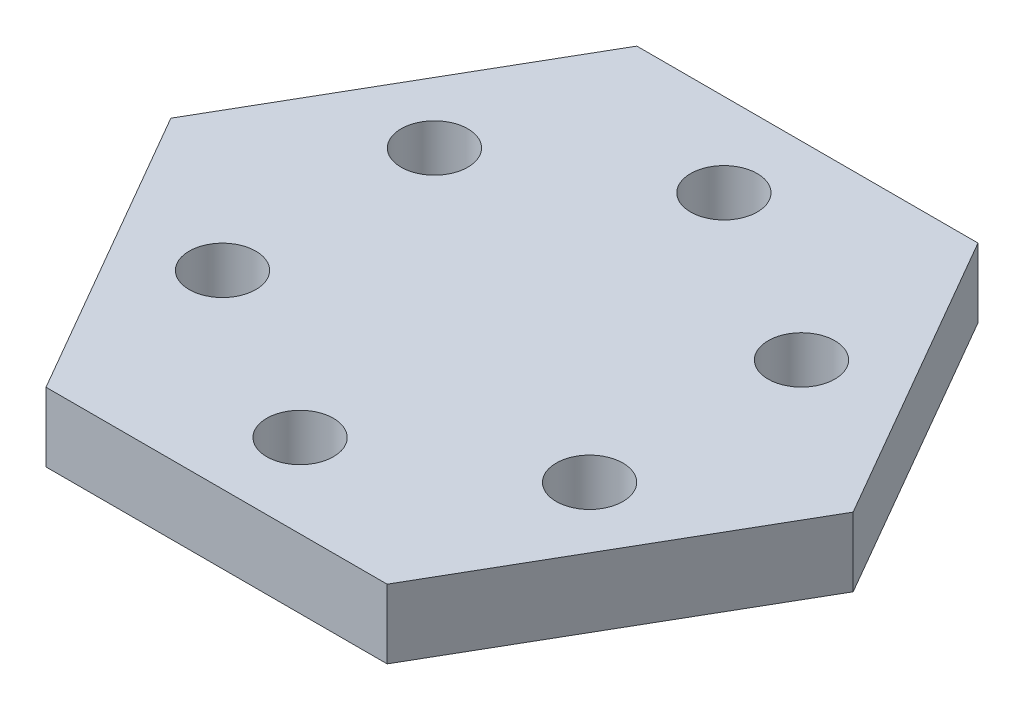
ISO-10303-21;
HEADER;
FILE_DESCRIPTION(('STEP AP214'),'2;1');
FILE_NAME('part.step','',(''),(''),'','','');
FILE_SCHEMA(('AUTOMOTIVE_DESIGN { 1 0 10303 214 1 1 1 1 }'));
ENDSEC;
DATA;
#1=APPLICATION_CONTEXT('core data for automotive mechanical design processes');
#2=APPLICATION_PROTOCOL_DEFINITION('international standard','automotive_design',2000,#1);
#3=PRODUCT_CONTEXT('',#1,'mechanical');
#4=PRODUCT('Part','Part','',(#3));
#5=PRODUCT_RELATED_PRODUCT_CATEGORY('part','',(#4));
#6=PRODUCT_DEFINITION_FORMATION('','',#4);
#7=PRODUCT_DEFINITION_CONTEXT('part definition',#1,'design');
#8=PRODUCT_DEFINITION('design','',#6,#7);
#9=PRODUCT_DEFINITION_SHAPE('','',#8);
#10=(LENGTH_UNIT() NAMED_UNIT(*) SI_UNIT(.MILLI.,.METRE.));
#11=(NAMED_UNIT(*) PLANE_ANGLE_UNIT() SI_UNIT($,.RADIAN.));
#12=(NAMED_UNIT(*) SI_UNIT($,.STERADIAN.) SOLID_ANGLE_UNIT());
#13=UNCERTAINTY_MEASURE_WITH_UNIT(LENGTH_MEASURE(1.E-05),#10,'distance_accuracy_value','');
#14=(GEOMETRIC_REPRESENTATION_CONTEXT(3) GLOBAL_UNCERTAINTY_ASSIGNED_CONTEXT((#13)) GLOBAL_UNIT_ASSIGNED_CONTEXT((#10,
#11,#12)) REPRESENTATION_CONTEXT('',''));
#15=CARTESIAN_POINT('',(0.,0.,0.));
#16=DIRECTION('',(0.,0.,1.));
#17=DIRECTION('',(1.,0.,0.));
#18=AXIS2_PLACEMENT_3D('',#15,#16,#17);
#19=CARTESIAN_POINT('',(-38.8991070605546,15.748,67.3752297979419));
#20=DIRECTION('',(0.,0.,-1.));
#21=DIRECTION('',(-1.,0.,0.));
#22=AXIS2_PLACEMENT_3D('',#19,#20,#21);
#23=PLANE('',#22);
#24=DIRECTION('',(1.,0.,0.));
#25=VECTOR('',#24,1.);
#26=CARTESIAN_POINT('',(-38.8991070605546,0.,67.3752297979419));
#27=LINE('',#26,#25);
#28=CARTESIAN_POINT('',(-38.8991070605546,0.,67.3752297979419));
#29=VERTEX_POINT('',#28);
#30=CARTESIAN_POINT('',(38.8991070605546,0.,67.3752297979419));
#31=VERTEX_POINT('',#30);
#32=EDGE_CURVE('E115',#29,#31,#27,.T.);
#33=ORIENTED_EDGE('',*,*,#32,.T.);
#34=DIRECTION('',(0.,-1.,0.));
#35=VECTOR('',#34,1.);
#36=CARTESIAN_POINT('',(38.8991070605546,15.748,67.3752297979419));
#37=LINE('',#36,#35);
#38=CARTESIAN_POINT('',(38.8991070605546,15.748,67.3752297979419));
#39=VERTEX_POINT('',#38);
#40=EDGE_CURVE('E11',#39,#31,#37,.T.);
#41=ORIENTED_EDGE('',*,*,#40,.F.);
#42=DIRECTION('',(1.,0.,0.));
#43=VECTOR('',#42,1.);
#44=CARTESIAN_POINT('',(-38.8991070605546,15.748,67.3752297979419));
#45=LINE('',#44,#43);
#46=CARTESIAN_POINT('',(-38.8991070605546,15.748,67.3752297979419));
#47=VERTEX_POINT('',#46);
#48=EDGE_CURVE('E126',#47,#39,#45,.T.);
#49=ORIENTED_EDGE('',*,*,#48,.F.);
#50=DIRECTION('',(0.,-1.,0.));
#51=VECTOR('',#50,1.);
#52=CARTESIAN_POINT('',(-38.8991070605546,15.748,67.3752297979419));
#53=LINE('',#52,#51);
#54=EDGE_CURVE('E111',#47,#29,#53,.T.);
#55=ORIENTED_EDGE('',*,*,#54,.T.);
#56=EDGE_LOOP('',(#33,#41,#49,#55));
#57=FACE_BOUND('',#56,.T.);
#58=ADVANCED_FACE('F31',(#57),#23,.F.);
#59=CARTESIAN_POINT('',(38.8991070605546,15.748,67.3752297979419));
#60=DIRECTION('',(-0.866025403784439,0.,-0.5));
#61=DIRECTION('',(-0.5,0.,0.866025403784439));
#62=AXIS2_PLACEMENT_3D('',#59,#60,#61);
#63=PLANE('',#62);
#64=DIRECTION('',(0.5,0.,-0.866025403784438));
#65=VECTOR('',#64,1.);
#66=CARTESIAN_POINT('',(38.8991070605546,0.,67.3752297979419));
#67=LINE('',#66,#65);
#68=CARTESIAN_POINT('',(77.7982141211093,0.,0.));
#69=VERTEX_POINT('',#68);
#70=EDGE_CURVE('E118',#31,#69,#67,.T.);
#71=ORIENTED_EDGE('',*,*,#70,.T.);
#72=DIRECTION('',(0.,-1.,0.));
#73=VECTOR('',#72,1.);
#74=CARTESIAN_POINT('',(77.7982141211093,15.748,0.));
#75=LINE('',#74,#73);
#76=CARTESIAN_POINT('',(77.7982141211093,15.748,0.));
#77=VERTEX_POINT('',#76);
#78=EDGE_CURVE('E39',#77,#69,#75,.T.);
#79=ORIENTED_EDGE('',*,*,#78,.F.);
#80=DIRECTION('',(0.5,0.,-0.866025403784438));
#81=VECTOR('',#80,1.);
#82=CARTESIAN_POINT('',(38.8991070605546,15.748,67.3752297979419));
#83=LINE('',#82,#81);
#84=EDGE_CURVE('E84',#39,#77,#83,.T.);
#85=ORIENTED_EDGE('',*,*,#84,.F.);
#86=ORIENTED_EDGE('',*,*,#40,.T.);
#87=EDGE_LOOP('',(#71,#79,#85,#86));
#88=FACE_BOUND('',#87,.T.);
#89=ADVANCED_FACE('F151',(#88),#63,.F.);
#90=CARTESIAN_POINT('',(77.7982141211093,15.748,0.));
#91=DIRECTION('',(-0.866025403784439,0.,0.5));
#92=DIRECTION('',(0.5,0.,0.866025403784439));
#93=AXIS2_PLACEMENT_3D('',#90,#91,#92);
#94=PLANE('',#93);
#95=DIRECTION('',(-0.5,0.,-0.866025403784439));
#96=VECTOR('',#95,1.);
#97=CARTESIAN_POINT('',(77.7982141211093,0.,0.));
#98=LINE('',#97,#96);
#99=CARTESIAN_POINT('',(38.8991070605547,0.,-67.3752297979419));
#100=VERTEX_POINT('',#99);
#101=EDGE_CURVE('E121',#69,#100,#98,.T.);
#102=ORIENTED_EDGE('',*,*,#101,.T.);
#103=DIRECTION('',(0.,-1.,0.));
#104=VECTOR('',#103,1.);
#105=CARTESIAN_POINT('',(38.8991070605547,15.748,-67.3752297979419));
#106=LINE('',#105,#104);
#107=CARTESIAN_POINT('',(38.8991070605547,15.748,-67.3752297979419));
#108=VERTEX_POINT('',#107);
#109=EDGE_CURVE('E106',#108,#100,#106,.T.);
#110=ORIENTED_EDGE('',*,*,#109,.F.);
#111=DIRECTION('',(-0.5,0.,-0.866025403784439));
#112=VECTOR('',#111,1.);
#113=CARTESIAN_POINT('',(77.7982141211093,15.748,0.));
#114=LINE('',#113,#112);
#115=EDGE_CURVE('E97',#77,#108,#114,.T.);
#116=ORIENTED_EDGE('',*,*,#115,.F.);
#117=ORIENTED_EDGE('',*,*,#78,.T.);
#118=EDGE_LOOP('',(#102,#110,#116,#117));
#119=FACE_BOUND('',#118,.T.);
#120=ADVANCED_FACE('F132',(#119),#94,.F.);
#121=CARTESIAN_POINT('',(38.8991070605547,15.748,-67.3752297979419));
#122=DIRECTION('',(0.,0.,1.));
#123=DIRECTION('',(1.,0.,0.));
#124=AXIS2_PLACEMENT_3D('',#121,#122,#123);
#125=PLANE('',#124);
#126=DIRECTION('',(-1.,0.,0.));
#127=VECTOR('',#126,1.);
#128=CARTESIAN_POINT('',(38.8991070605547,0.,-67.3752297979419));
#129=LINE('',#128,#127);
#130=CARTESIAN_POINT('',(-38.8991070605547,0.,-67.3752297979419));
#131=VERTEX_POINT('',#130);
#132=EDGE_CURVE('E105',#100,#131,#129,.T.);
#133=ORIENTED_EDGE('',*,*,#132,.T.);
#134=DIRECTION('',(0.,-1.,0.));
#135=VECTOR('',#134,1.);
#136=CARTESIAN_POINT('',(-38.8991070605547,15.748,-67.3752297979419));
#137=LINE('',#136,#135);
#138=CARTESIAN_POINT('',(-38.8991070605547,15.748,-67.3752297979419));
#139=VERTEX_POINT('',#138);
#140=EDGE_CURVE('E102',#139,#131,#137,.T.);
#141=ORIENTED_EDGE('',*,*,#140,.F.);
#142=DIRECTION('',(-1.,0.,0.));
#143=VECTOR('',#142,1.);
#144=CARTESIAN_POINT('',(38.8991070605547,15.748,-67.3752297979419));
#145=LINE('',#144,#143);
#146=EDGE_CURVE('E91',#108,#139,#145,.T.);
#147=ORIENTED_EDGE('',*,*,#146,.F.);
#148=ORIENTED_EDGE('',*,*,#109,.T.);
#149=EDGE_LOOP('',(#133,#141,#147,#148));
#150=FACE_BOUND('',#149,.T.);
#151=ADVANCED_FACE('F103',(#150),#125,.F.);
#152=CARTESIAN_POINT('',(-38.8991070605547,15.748,-67.3752297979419));
#153=DIRECTION('',(0.866025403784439,0.,0.5));
#154=DIRECTION('',(0.5,0.,-0.866025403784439));
#155=AXIS2_PLACEMENT_3D('',#152,#153,#154);
#156=PLANE('',#155);
#157=DIRECTION('',(-0.5,0.,0.866025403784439));
#158=VECTOR('',#157,1.);
#159=CARTESIAN_POINT('',(-38.8991070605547,0.,-67.3752297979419));
#160=LINE('',#159,#158);
#161=CARTESIAN_POINT('',(-77.7982141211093,0.,0.));
#162=VERTEX_POINT('',#161);
#163=EDGE_CURVE('E70',#131,#162,#160,.T.);
#164=ORIENTED_EDGE('',*,*,#163,.T.);
#165=DIRECTION('',(0.,-1.,0.));
#166=VECTOR('',#165,1.);
#167=CARTESIAN_POINT('',(-77.7982141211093,15.748,0.));
#168=LINE('',#167,#166);
#169=CARTESIAN_POINT('',(-77.7982141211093,15.748,0.));
#170=VERTEX_POINT('',#169);
#171=EDGE_CURVE('E107',#170,#162,#168,.T.);
#172=ORIENTED_EDGE('',*,*,#171,.F.);
#173=DIRECTION('',(-0.5,0.,0.866025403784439));
#174=VECTOR('',#173,1.);
#175=CARTESIAN_POINT('',(-38.8991070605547,15.748,-67.3752297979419));
#176=LINE('',#175,#174);
#177=EDGE_CURVE('E95',#139,#170,#176,.T.);
#178=ORIENTED_EDGE('',*,*,#177,.F.);
#179=ORIENTED_EDGE('',*,*,#140,.T.);
#180=EDGE_LOOP('',(#164,#172,#178,#179));
#181=FACE_BOUND('',#180,.T.);
#182=ADVANCED_FACE('F109',(#181),#156,.F.);
#183=CARTESIAN_POINT('',(-77.7982141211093,15.748,0.));
#184=DIRECTION('',(0.866025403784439,0.,-0.5));
#185=DIRECTION('',(-0.5,0.,-0.866025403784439));
#186=AXIS2_PLACEMENT_3D('',#183,#184,#185);
#187=PLANE('',#186);
#188=DIRECTION('',(0.5,0.,0.866025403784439));
#189=VECTOR('',#188,1.);
#190=CARTESIAN_POINT('',(-77.7982141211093,0.,0.));
#191=LINE('',#190,#189);
#192=EDGE_CURVE('E76',#162,#29,#191,.T.);
#193=ORIENTED_EDGE('',*,*,#192,.T.);
#194=ORIENTED_EDGE('',*,*,#54,.F.);
#195=DIRECTION('',(0.5,0.,0.866025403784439));
#196=VECTOR('',#195,1.);
#197=CARTESIAN_POINT('',(-77.7982141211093,15.748,0.));
#198=LINE('',#197,#196);
#199=EDGE_CURVE('E47',#170,#47,#198,.T.);
#200=ORIENTED_EDGE('',*,*,#199,.F.);
#201=ORIENTED_EDGE('',*,*,#171,.T.);
#202=EDGE_LOOP('',(#193,#194,#200,#201));
#203=FACE_BOUND('',#202,.T.);
#204=ADVANCED_FACE('F139',(#203),#187,.F.);
#205=CARTESIAN_POINT('',(38.8991070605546,15.748,67.3752297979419));
#206=DIRECTION('',(0.,1.,0.));
#207=DIRECTION('',(0.,0.,1.));
#208=AXIS2_PLACEMENT_3D('',#205,#206,#207);
#209=PLANE('',#208);
#210=CARTESIAN_POINT('',(41.8552111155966,15.748,24.165117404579));
#211=DIRECTION('',(0.,1.,0.));
#212=DIRECTION('',(0.866025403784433,0.,0.50000000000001));
#213=AXIS2_PLACEMENT_3D('',#210,#211,#212);
#214=CIRCLE('',#213,7.60476981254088);
#215=CARTESIAN_POINT('',(48.44113496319,15.748,27.9675023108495));
#216=VERTEX_POINT('',#215);
#217=EDGE_CURVE('E257',#216,#216,#214,.T.);
#218=ORIENTED_EDGE('',*,*,#217,.F.);
#219=EDGE_LOOP('',(#218));
#220=FACE_BOUND('',#219,.T.);
#221=CARTESIAN_POINT('',(41.8552111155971,15.748,-24.1651174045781));
#222=DIRECTION('',(0.,1.,0.));
#223=DIRECTION('',(0.866025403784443,0.,-0.499999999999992));
#224=AXIS2_PLACEMENT_3D('',#221,#222,#223);
#225=CIRCLE('',#224,7.60476981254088);
#226=CARTESIAN_POINT('',(48.4411349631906,15.748,-27.9675023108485));
#227=VERTEX_POINT('',#226);
#228=EDGE_CURVE('E259',#227,#227,#225,.T.);
#229=ORIENTED_EDGE('',*,*,#228,.F.);
#230=EDGE_LOOP('',(#229));
#231=FACE_BOUND('',#230,.T.);
#232=CARTESIAN_POINT('',(3.37488421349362E-13,15.748,-48.330234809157));
#233=DIRECTION('',(0.,1.,0.));
#234=DIRECTION('',(0.,0.,-1.));
#235=AXIS2_PLACEMENT_3D('',#232,#233,#234);
#236=CIRCLE('',#235,7.60476981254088);
#237=CARTESIAN_POINT('',(3.90592275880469E-13,15.748,-55.9350046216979));
#238=VERTEX_POINT('',#237);
#239=EDGE_CURVE('E265',#238,#238,#236,.T.);
#240=ORIENTED_EDGE('',*,*,#239,.F.);
#241=EDGE_LOOP('',(#240));
#242=FACE_BOUND('',#241,.T.);
#243=CARTESIAN_POINT('',(-41.8552111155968,15.748,-24.1651174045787));
#244=DIRECTION('',(0.,1.,0.));
#245=DIRECTION('',(-0.866025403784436,0.,-0.500000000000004));
#246=AXIS2_PLACEMENT_3D('',#243,#244,#245);
#247=CIRCLE('',#246,7.60476981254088);
#248=CARTESIAN_POINT('',(-48.4411349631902,15.748,-27.9675023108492));
#249=VERTEX_POINT('',#248);
#250=EDGE_CURVE('E271',#249,#249,#247,.T.);
#251=ORIENTED_EDGE('',*,*,#250,.F.);
#252=EDGE_LOOP('',(#251));
#253=FACE_BOUND('',#252,.T.);
#254=CARTESIAN_POINT('',(-41.855211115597,15.748,24.1651174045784));
#255=DIRECTION('',(0.,1.,0.));
#256=DIRECTION('',(-0.86602540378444,0.,0.499999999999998));
#257=AXIS2_PLACEMENT_3D('',#254,#255,#256);
#258=CIRCLE('',#257,7.60476981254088);
#259=CARTESIAN_POINT('',(-48.4411349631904,15.748,27.9675023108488));
#260=VERTEX_POINT('',#259);
#261=EDGE_CURVE('E277',#260,#260,#258,.T.);
#262=ORIENTED_EDGE('',*,*,#261,.F.);
#263=EDGE_LOOP('',(#262));
#264=FACE_BOUND('',#263,.T.);
#265=CARTESIAN_POINT('',(0.,15.748,48.330234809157));
#266=DIRECTION('',(0.,1.,0.));
#267=DIRECTION('',(0.,0.,1.));
#268=AXIS2_PLACEMENT_3D('',#265,#266,#267);
#269=CIRCLE('',#268,7.60476981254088);
#270=CARTESIAN_POINT('',(0.,15.748,55.9350046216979));
#271=VERTEX_POINT('',#270);
#272=EDGE_CURVE('E283',#271,#271,#269,.T.);
#273=ORIENTED_EDGE('',*,*,#272,.F.);
#274=EDGE_LOOP('',(#273));
#275=FACE_BOUND('',#274,.T.);
#276=ORIENTED_EDGE('',*,*,#48,.T.);
#277=ORIENTED_EDGE('',*,*,#84,.T.);
#278=ORIENTED_EDGE('',*,*,#115,.T.);
#279=ORIENTED_EDGE('',*,*,#146,.T.);
#280=ORIENTED_EDGE('',*,*,#177,.T.);
#281=ORIENTED_EDGE('',*,*,#199,.T.);
#282=EDGE_LOOP('',(#276,#277,#278,#279,#280,#281));
#283=FACE_BOUND('',#282,.T.);
#284=ADVANCED_FACE('F93',(#220,#231,#242,#253,#264,#275,#283),#209,.T.);
#285=CARTESIAN_POINT('',(38.8991070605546,0.,67.3752297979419));
#286=DIRECTION('',(0.,1.,0.));
#287=DIRECTION('',(0.,0.,1.));
#288=AXIS2_PLACEMENT_3D('',#285,#286,#287);
#289=PLANE('',#288);
#290=CARTESIAN_POINT('',(41.8552111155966,0.,24.165117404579));
#291=DIRECTION('',(0.,1.,0.));
#292=DIRECTION('',(0.866025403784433,0.,0.50000000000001));
#293=AXIS2_PLACEMENT_3D('',#290,#291,#292);
#294=CIRCLE('',#293,7.60476981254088);
#295=CARTESIAN_POINT('',(48.44113496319,0.,27.9675023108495));
#296=VERTEX_POINT('',#295);
#297=EDGE_CURVE('E254',#296,#296,#294,.T.);
#298=ORIENTED_EDGE('',*,*,#297,.T.);
#299=EDGE_LOOP('',(#298));
#300=FACE_BOUND('',#299,.T.);
#301=CARTESIAN_POINT('',(41.8552111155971,0.,-24.1651174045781));
#302=DIRECTION('',(0.,1.,0.));
#303=DIRECTION('',(0.866025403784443,0.,-0.499999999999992));
#304=AXIS2_PLACEMENT_3D('',#301,#302,#303);
#305=CIRCLE('',#304,7.60476981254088);
#306=CARTESIAN_POINT('',(48.4411349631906,0.,-27.9675023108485));
#307=VERTEX_POINT('',#306);
#308=EDGE_CURVE('E262',#307,#307,#305,.T.);
#309=ORIENTED_EDGE('',*,*,#308,.T.);
#310=EDGE_LOOP('',(#309));
#311=FACE_BOUND('',#310,.T.);
#312=CARTESIAN_POINT('',(3.37488421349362E-13,0.,-48.330234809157));
#313=DIRECTION('',(0.,1.,0.));
#314=DIRECTION('',(0.,0.,-1.));
#315=AXIS2_PLACEMENT_3D('',#312,#313,#314);
#316=CIRCLE('',#315,7.60476981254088);
#317=CARTESIAN_POINT('',(3.90592275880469E-13,0.,-55.9350046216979));
#318=VERTEX_POINT('',#317);
#319=EDGE_CURVE('E268',#318,#318,#316,.T.);
#320=ORIENTED_EDGE('',*,*,#319,.T.);
#321=EDGE_LOOP('',(#320));
#322=FACE_BOUND('',#321,.T.);
#323=CARTESIAN_POINT('',(-41.8552111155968,0.,-24.1651174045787));
#324=DIRECTION('',(0.,1.,0.));
#325=DIRECTION('',(-0.866025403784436,0.,-0.500000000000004));
#326=AXIS2_PLACEMENT_3D('',#323,#324,#325);
#327=CIRCLE('',#326,7.60476981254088);
#328=CARTESIAN_POINT('',(-48.4411349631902,0.,-27.9675023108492));
#329=VERTEX_POINT('',#328);
#330=EDGE_CURVE('E274',#329,#329,#327,.T.);
#331=ORIENTED_EDGE('',*,*,#330,.T.);
#332=EDGE_LOOP('',(#331));
#333=FACE_BOUND('',#332,.T.);
#334=CARTESIAN_POINT('',(-41.855211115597,0.,24.1651174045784));
#335=DIRECTION('',(0.,1.,0.));
#336=DIRECTION('',(-0.86602540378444,0.,0.499999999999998));
#337=AXIS2_PLACEMENT_3D('',#334,#335,#336);
#338=CIRCLE('',#337,7.60476981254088);
#339=CARTESIAN_POINT('',(-48.4411349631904,0.,27.9675023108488));
#340=VERTEX_POINT('',#339);
#341=EDGE_CURVE('E280',#340,#340,#338,.T.);
#342=ORIENTED_EDGE('',*,*,#341,.T.);
#343=EDGE_LOOP('',(#342));
#344=FACE_BOUND('',#343,.T.);
#345=CARTESIAN_POINT('',(0.,0.,48.330234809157));
#346=DIRECTION('',(0.,1.,0.));
#347=DIRECTION('',(0.,0.,1.));
#348=AXIS2_PLACEMENT_3D('',#345,#346,#347);
#349=CIRCLE('',#348,7.60476981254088);
#350=CARTESIAN_POINT('',(0.,0.,55.9350046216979));
#351=VERTEX_POINT('',#350);
#352=EDGE_CURVE('E119',#351,#351,#349,.T.);
#353=ORIENTED_EDGE('',*,*,#352,.T.);
#354=EDGE_LOOP('',(#353));
#355=FACE_BOUND('',#354,.T.);
#356=ORIENTED_EDGE('',*,*,#32,.F.);
#357=ORIENTED_EDGE('',*,*,#192,.F.);
#358=ORIENTED_EDGE('',*,*,#163,.F.);
#359=ORIENTED_EDGE('',*,*,#132,.F.);
#360=ORIENTED_EDGE('',*,*,#101,.F.);
#361=ORIENTED_EDGE('',*,*,#70,.F.);
#362=EDGE_LOOP('',(#356,#357,#358,#359,#360,#361));
#363=FACE_BOUND('',#362,.T.);
#364=ADVANCED_FACE('F135',(#300,#311,#322,#333,#344,#355,#363),#289,.F.);
#365=CARTESIAN_POINT('',(0.,0.,48.330234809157));
#366=DIRECTION('',(0.,1.,0.));
#367=DIRECTION('',(0.,0.,1.));
#368=AXIS2_PLACEMENT_3D('',#365,#366,#367);
#369=CYLINDRICAL_SURFACE('',#368,7.60476981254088);
#370=ORIENTED_EDGE('',*,*,#352,.F.);
#371=EDGE_LOOP('',(#370));
#372=FACE_BOUND('',#371,.T.);
#373=ORIENTED_EDGE('',*,*,#272,.T.);
#374=EDGE_LOOP('',(#373));
#375=FACE_BOUND('',#374,.T.);
#376=ADVANCED_FACE('F179',(#372,#375),#369,.F.);
#377=CARTESIAN_POINT('',(-41.855211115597,0.,24.1651174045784));
#378=DIRECTION('',(0.,1.,0.));
#379=DIRECTION('',(0.,0.,1.));
#380=AXIS2_PLACEMENT_3D('',#377,#378,#379);
#381=CYLINDRICAL_SURFACE('',#380,7.60476981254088);
#382=ORIENTED_EDGE('',*,*,#341,.F.);
#383=EDGE_LOOP('',(#382));
#384=FACE_BOUND('',#383,.T.);
#385=ORIENTED_EDGE('',*,*,#261,.T.);
#386=EDGE_LOOP('',(#385));
#387=FACE_BOUND('',#386,.T.);
#388=ADVANCED_FACE('F184',(#384,#387),#381,.F.);
#389=CARTESIAN_POINT('',(-41.8552111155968,0.,-24.1651174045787));
#390=DIRECTION('',(0.,1.,0.));
#391=DIRECTION('',(0.,0.,1.));
#392=AXIS2_PLACEMENT_3D('',#389,#390,#391);
#393=CYLINDRICAL_SURFACE('',#392,7.60476981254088);
#394=ORIENTED_EDGE('',*,*,#330,.F.);
#395=EDGE_LOOP('',(#394));
#396=FACE_BOUND('',#395,.T.);
#397=ORIENTED_EDGE('',*,*,#250,.T.);
#398=EDGE_LOOP('',(#397));
#399=FACE_BOUND('',#398,.T.);
#400=ADVANCED_FACE('F207',(#396,#399),#393,.F.);
#401=CARTESIAN_POINT('',(3.37488421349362E-13,0.,-48.330234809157));
#402=DIRECTION('',(0.,1.,0.));
#403=DIRECTION('',(0.,0.,1.));
#404=AXIS2_PLACEMENT_3D('',#401,#402,#403);
#405=CYLINDRICAL_SURFACE('',#404,7.60476981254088);
#406=ORIENTED_EDGE('',*,*,#319,.F.);
#407=EDGE_LOOP('',(#406));
#408=FACE_BOUND('',#407,.T.);
#409=ORIENTED_EDGE('',*,*,#239,.T.);
#410=EDGE_LOOP('',(#409));
#411=FACE_BOUND('',#410,.T.);
#412=ADVANCED_FACE('F217',(#408,#411),#405,.F.);
#413=CARTESIAN_POINT('',(41.8552111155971,0.,-24.1651174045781));
#414=DIRECTION('',(0.,1.,0.));
#415=DIRECTION('',(0.,0.,1.));
#416=AXIS2_PLACEMENT_3D('',#413,#414,#415);
#417=CYLINDRICAL_SURFACE('',#416,7.60476981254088);
#418=ORIENTED_EDGE('',*,*,#308,.F.);
#419=EDGE_LOOP('',(#418));
#420=FACE_BOUND('',#419,.T.);
#421=ORIENTED_EDGE('',*,*,#228,.T.);
#422=EDGE_LOOP('',(#421));
#423=FACE_BOUND('',#422,.T.);
#424=ADVANCED_FACE('F227',(#420,#423),#417,.F.);
#425=CARTESIAN_POINT('',(41.8552111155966,0.,24.165117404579));
#426=DIRECTION('',(0.,1.,0.));
#427=DIRECTION('',(0.,0.,1.));
#428=AXIS2_PLACEMENT_3D('',#425,#426,#427);
#429=CYLINDRICAL_SURFACE('',#428,7.60476981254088);
#430=ORIENTED_EDGE('',*,*,#297,.F.);
#431=EDGE_LOOP('',(#430));
#432=FACE_BOUND('',#431,.T.);
#433=ORIENTED_EDGE('',*,*,#217,.T.);
#434=EDGE_LOOP('',(#433));
#435=FACE_BOUND('',#434,.T.);
#436=ADVANCED_FACE('F237',(#432,#435),#429,.F.);
#437=CLOSED_SHELL('',(#58,#89,#120,#151,#182,#204,#284,#364,#376,#388,#400,#412,#424,#436));
#438=MANIFOLD_SOLID_BREP('B2',#437);
#439=ADVANCED_BREP_SHAPE_REPRESENTATION('',(#18,#438),#14);
#440=SHAPE_DEFINITION_REPRESENTATION(#9,#439);
ENDSEC;
END-ISO-10303-21;
